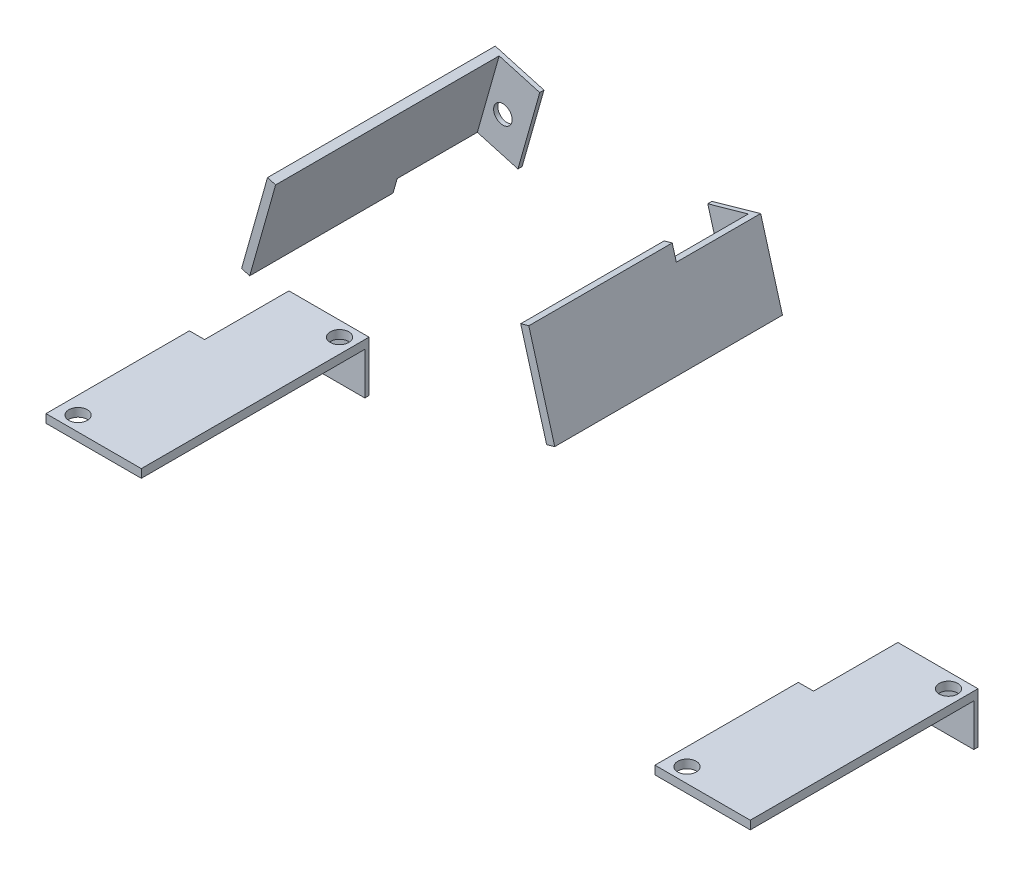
ISO-10303-21;
HEADER;
FILE_DESCRIPTION(('STEP AP214'),'2;1');
FILE_NAME('part.step','',(''),(''),'','','');
FILE_SCHEMA(('AUTOMOTIVE_DESIGN { 1 0 10303 214 1 1 1 1 }'));
ENDSEC;
DATA;
#1=APPLICATION_CONTEXT('core data for automotive mechanical design processes');
#2=APPLICATION_PROTOCOL_DEFINITION('international standard','automotive_design',2000,#1);
#3=PRODUCT_CONTEXT('',#1,'mechanical');
#4=PRODUCT('Part','Part','',(#3));
#5=PRODUCT_RELATED_PRODUCT_CATEGORY('part','',(#4));
#6=PRODUCT_DEFINITION_FORMATION('','',#4);
#7=PRODUCT_DEFINITION_CONTEXT('part definition',#1,'design');
#8=PRODUCT_DEFINITION('design','',#6,#7);
#9=PRODUCT_DEFINITION_SHAPE('','',#8);
#10=(LENGTH_UNIT() NAMED_UNIT(*) SI_UNIT(.MILLI.,.METRE.));
#11=(NAMED_UNIT(*) PLANE_ANGLE_UNIT() SI_UNIT($,.RADIAN.));
#12=(NAMED_UNIT(*) SI_UNIT($,.STERADIAN.) SOLID_ANGLE_UNIT());
#13=UNCERTAINTY_MEASURE_WITH_UNIT(LENGTH_MEASURE(1.E-05),#10,'distance_accuracy_value','');
#14=(GEOMETRIC_REPRESENTATION_CONTEXT(3) GLOBAL_UNCERTAINTY_ASSIGNED_CONTEXT((#13)) GLOBAL_UNIT_ASSIGNED_CONTEXT((#10,
#11,#12)) REPRESENTATION_CONTEXT('',''));
#15=CARTESIAN_POINT('',(0.,0.,0.));
#16=DIRECTION('',(0.,0.,1.));
#17=DIRECTION('',(1.,0.,0.));
#18=AXIS2_PLACEMENT_3D('',#15,#16,#17);
#19=CARTESIAN_POINT('',(-18.1233223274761,39.222379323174,27.));
#20=DIRECTION('',(0.272092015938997,0.96227123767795,0.));
#21=DIRECTION('',(-0.96227123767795,0.272092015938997,0.));
#22=AXIS2_PLACEMENT_3D('',#19,#20,#21);
#23=PLANE('',#22);
#24=DIRECTION('',(0.962271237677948,-0.272092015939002,0.));
#25=VECTOR('',#24,1.);
#26=CARTESIAN_POINT('',(-18.1233223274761,39.222379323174,10.));
#27=LINE('',#26,#25);
#28=CARTESIAN_POINT('',(-18.1233223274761,39.222379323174,10.));
#29=VERTEX_POINT('',#28);
#30=CARTESIAN_POINT('',(-17.1610510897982,38.950287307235,10.));
#31=VERTEX_POINT('',#30);
#32=EDGE_CURVE('E64',#29,#31,#27,.T.);
#33=ORIENTED_EDGE('',*,*,#32,.F.);
#34=DIRECTION('',(0.,0.,-1.));
#35=VECTOR('',#34,1.);
#36=CARTESIAN_POINT('',(-18.1233223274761,39.222379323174,27.));
#37=LINE('',#36,#35);
#38=CARTESIAN_POINT('',(-18.1233223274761,39.222379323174,0.));
#39=VERTEX_POINT('',#38);
#40=EDGE_CURVE('E138',#29,#39,#37,.T.);
#41=ORIENTED_EDGE('',*,*,#40,.T.);
#42=DIRECTION('',(0.96227123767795,-0.272092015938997,0.));
#43=VECTOR('',#42,1.);
#44=CARTESIAN_POINT('',(-18.1233223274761,39.222379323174,0.));
#45=LINE('',#44,#43);
#46=CARTESIAN_POINT('',(-12.3496949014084,37.5898272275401,0.));
#47=VERTEX_POINT('',#46);
#48=EDGE_CURVE('E172',#39,#47,#45,.T.);
#49=ORIENTED_EDGE('',*,*,#48,.T.);
#50=DIRECTION('',(0.,0.,-1.));
#51=VECTOR('',#50,1.);
#52=CARTESIAN_POINT('',(-12.3496949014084,37.5898272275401,27.));
#53=LINE('',#52,#51);
#54=CARTESIAN_POINT('',(-12.3496949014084,37.5898272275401,0.5));
#55=VERTEX_POINT('',#54);
#56=EDGE_CURVE('E158',#55,#47,#53,.T.);
#57=ORIENTED_EDGE('',*,*,#56,.F.);
#58=DIRECTION('',(0.962271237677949,-0.272092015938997,0.));
#59=VECTOR('',#58,1.);
#60=CARTESIAN_POINT('',(-12.3496949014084,37.5898272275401,0.5));
#61=LINE('',#60,#59);
#62=CARTESIAN_POINT('',(-17.1610510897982,38.950287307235,0.5));
#63=VERTEX_POINT('',#62);
#64=EDGE_CURVE('E146',#63,#55,#61,.T.);
#65=ORIENTED_EDGE('',*,*,#64,.F.);
#66=DIRECTION('',(0.,0.,1.));
#67=VECTOR('',#66,1.);
#68=CARTESIAN_POINT('',(-17.1610510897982,38.950287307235,0.5));
#69=LINE('',#68,#67);
#70=EDGE_CURVE('E139',#63,#31,#69,.T.);
#71=ORIENTED_EDGE('',*,*,#70,.T.);
#72=EDGE_LOOP('',(#33,#41,#49,#57,#65,#71));
#73=FACE_BOUND('',#72,.T.);
#74=ADVANCED_FACE('F48',(#73),#23,.F.);
#75=CARTESIAN_POINT('',(0.,0.,27.));
#76=DIRECTION('',(0.,0.,-1.));
#77=DIRECTION('',(-1.,0.,0.));
#78=AXIS2_PLACEMENT_3D('',#75,#76,#77);
#79=PLANE('',#78);
#80=DIRECTION('',(-0.272092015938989,-0.962271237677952,0.));
#81=VECTOR('',#80,1.);
#82=CARTESIAN_POINT('',(-18.1233223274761,39.222379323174,27.));
#83=LINE('',#82,#81);
#84=CARTESIAN_POINT('',(-15.5384481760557,48.3639560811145,27.));
#85=VERTEX_POINT('',#84);
#86=CARTESIAN_POINT('',(-18.6130879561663,37.4902910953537,27.));
#87=VERTEX_POINT('',#86);
#88=EDGE_CURVE('E169',#85,#87,#83,.T.);
#89=ORIENTED_EDGE('',*,*,#88,.T.);
#90=DIRECTION('',(-0.962271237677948,0.272092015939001,0.));
#91=VECTOR('',#90,1.);
#92=CARTESIAN_POINT('',(-18.6130879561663,37.4902910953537,27.));
#93=LINE('',#92,#91);
#94=CARTESIAN_POINT('',(-17.6508167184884,37.2181990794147,27.));
#95=VERTEX_POINT('',#94);
#96=EDGE_CURVE('E132',#95,#87,#93,.T.);
#97=ORIENTED_EDGE('',*,*,#96,.F.);
#98=DIRECTION('',(-0.272092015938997,-0.96227123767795,0.));
#99=VECTOR('',#98,1.);
#100=CARTESIAN_POINT('',(-17.1610510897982,38.950287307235,27.));
#101=LINE('',#100,#99);
#102=CARTESIAN_POINT('',(-14.5761769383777,48.0918640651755,27.));
#103=VERTEX_POINT('',#102);
#104=EDGE_CURVE('E148',#103,#95,#101,.T.);
#105=ORIENTED_EDGE('',*,*,#104,.F.);
#106=DIRECTION('',(-0.962271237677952,0.272092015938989,0.));
#107=VECTOR('',#106,1.);
#108=CARTESIAN_POINT('',(-15.5384481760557,48.3639560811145,27.));
#109=LINE('',#108,#107);
#110=EDGE_CURVE('E165',#103,#85,#109,.T.);
#111=ORIENTED_EDGE('',*,*,#110,.T.);
#112=EDGE_LOOP('',(#89,#97,#105,#111));
#113=FACE_BOUND('',#112,.T.);
#114=ADVANCED_FACE('F178',(#113),#79,.F.);
#115=CARTESIAN_POINT('',(0.,0.,0.));
#116=DIRECTION('',(0.,0.,-1.));
#117=DIRECTION('',(-1.,0.,0.));
#118=AXIS2_PLACEMENT_3D('',#115,#116,#117);
#119=PLANE('',#118);
#120=DIRECTION('',(-0.272092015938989,-0.962271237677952,0.));
#121=VECTOR('',#120,1.);
#122=CARTESIAN_POINT('',(-18.1233223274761,39.222379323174,0.));
#123=LINE('',#122,#121);
#124=CARTESIAN_POINT('',(-15.5384481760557,48.3639560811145,0.));
#125=VERTEX_POINT('',#124);
#126=EDGE_CURVE('E57',#125,#39,#123,.T.);
#127=ORIENTED_EDGE('',*,*,#126,.F.);
#128=DIRECTION('',(-0.962271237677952,0.272092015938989,0.));
#129=VECTOR('',#128,1.);
#130=CARTESIAN_POINT('',(-15.5384481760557,48.3639560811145,0.));
#131=LINE('',#130,#129);
#132=CARTESIAN_POINT('',(-9.76482074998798,46.7314039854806,0.));
#133=VERTEX_POINT('',#132);
#134=EDGE_CURVE('E166',#133,#125,#131,.T.);
#135=ORIENTED_EDGE('',*,*,#134,.F.);
#136=DIRECTION('',(0.272092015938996,0.96227123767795,0.));
#137=VECTOR('',#136,1.);
#138=CARTESIAN_POINT('',(-9.76482074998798,46.7314039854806,0.));
#139=LINE('',#138,#137);
#140=EDGE_CURVE('E168',#47,#133,#139,.T.);
#141=ORIENTED_EDGE('',*,*,#140,.F.);
#142=ORIENTED_EDGE('',*,*,#48,.F.);
#143=EDGE_LOOP('',(#127,#135,#141,#142));
#144=FACE_BOUND('',#143,.T.);
#145=CARTESIAN_POINT('',(-14.1349171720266,42.3019535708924,0.));
#146=DIRECTION('',(0.,0.,1.));
#147=DIRECTION('',(1.,0.,0.));
#148=AXIS2_PLACEMENT_3D('',#145,#146,#147);
#149=CIRCLE('',#148,1.09999999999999);
#150=CARTESIAN_POINT('',(-13.0349171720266,42.3019535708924,0.));
#151=VERTEX_POINT('',#150);
#152=EDGE_CURVE('E12',#151,#151,#149,.T.);
#153=ORIENTED_EDGE('',*,*,#152,.T.);
#154=EDGE_LOOP('',(#153));
#155=FACE_BOUND('',#154,.T.);
#156=ADVANCED_FACE('F187',(#144,#155),#119,.T.);
#157=CARTESIAN_POINT('',(-18.1233223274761,39.222379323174,27.));
#158=DIRECTION('',(0.962271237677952,-0.272092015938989,0.));
#159=DIRECTION('',(0.272092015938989,0.962271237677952,0.));
#160=AXIS2_PLACEMENT_3D('',#157,#158,#159);
#161=PLANE('',#160);
#162=ORIENTED_EDGE('',*,*,#126,.T.);
#163=ORIENTED_EDGE('',*,*,#40,.F.);
#164=DIRECTION('',(0.272092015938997,0.962271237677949,0.));
#165=VECTOR('',#164,1.);
#166=CARTESIAN_POINT('',(-18.6130879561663,37.4902910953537,10.));
#167=LINE('',#166,#165);
#168=CARTESIAN_POINT('',(-18.6130879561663,37.4902910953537,10.));
#169=VERTEX_POINT('',#168);
#170=EDGE_CURVE('E119',#169,#29,#167,.T.);
#171=ORIENTED_EDGE('',*,*,#170,.F.);
#172=DIRECTION('',(0.,0.,-1.));
#173=VECTOR('',#172,1.);
#174=CARTESIAN_POINT('',(-18.6130879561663,37.4902910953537,27.));
#175=LINE('',#174,#173);
#176=EDGE_CURVE('E126',#87,#169,#175,.T.);
#177=ORIENTED_EDGE('',*,*,#176,.F.);
#178=ORIENTED_EDGE('',*,*,#88,.F.);
#179=DIRECTION('',(0.,0.,-1.));
#180=VECTOR('',#179,1.);
#181=CARTESIAN_POINT('',(-15.5384481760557,48.3639560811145,27.));
#182=LINE('',#181,#180);
#183=EDGE_CURVE('E162',#85,#125,#182,.T.);
#184=ORIENTED_EDGE('',*,*,#183,.T.);
#185=EDGE_LOOP('',(#162,#163,#171,#177,#178,#184));
#186=FACE_BOUND('',#185,.T.);
#187=ADVANCED_FACE('F137',(#186),#161,.F.);
#188=CARTESIAN_POINT('',(-9.76482074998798,46.7314039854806,27.));
#189=DIRECTION('',(-0.96227123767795,0.272092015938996,0.));
#190=DIRECTION('',(-0.272092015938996,-0.96227123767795,0.));
#191=AXIS2_PLACEMENT_3D('',#188,#189,#190);
#192=PLANE('',#191);
#193=DIRECTION('',(0.,0.,-1.));
#194=VECTOR('',#193,1.);
#195=CARTESIAN_POINT('',(-9.76482074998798,46.7314039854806,27.));
#196=LINE('',#195,#194);
#197=CARTESIAN_POINT('',(-9.76482074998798,46.7314039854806,0.5));
#198=VERTEX_POINT('',#197);
#199=EDGE_CURVE('E160',#198,#133,#196,.T.);
#200=ORIENTED_EDGE('',*,*,#199,.F.);
#201=DIRECTION('',(0.272092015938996,0.96227123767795,0.));
#202=VECTOR('',#201,1.);
#203=CARTESIAN_POINT('',(-9.76482074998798,46.7314039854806,0.5));
#204=LINE('',#203,#202);
#205=EDGE_CURVE('E72',#55,#198,#204,.T.);
#206=ORIENTED_EDGE('',*,*,#205,.F.);
#207=ORIENTED_EDGE('',*,*,#56,.T.);
#208=ORIENTED_EDGE('',*,*,#140,.T.);
#209=EDGE_LOOP('',(#200,#206,#207,#208));
#210=FACE_BOUND('',#209,.T.);
#211=ADVANCED_FACE('F194',(#210),#192,.F.);
#212=CARTESIAN_POINT('',(-15.5384481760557,48.3639560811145,27.));
#213=DIRECTION('',(-0.272092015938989,-0.962271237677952,0.));
#214=DIRECTION('',(0.962271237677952,-0.272092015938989,0.));
#215=AXIS2_PLACEMENT_3D('',#212,#213,#214);
#216=PLANE('',#215);
#217=ORIENTED_EDGE('',*,*,#110,.F.);
#218=DIRECTION('',(0.,0.,1.));
#219=VECTOR('',#218,1.);
#220=CARTESIAN_POINT('',(-14.5761769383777,48.0918640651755,0.5));
#221=LINE('',#220,#219);
#222=CARTESIAN_POINT('',(-14.5761769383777,48.0918640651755,0.5));
#223=VERTEX_POINT('',#222);
#224=EDGE_CURVE('E141',#223,#103,#221,.T.);
#225=ORIENTED_EDGE('',*,*,#224,.F.);
#226=DIRECTION('',(-0.962271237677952,0.272092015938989,0.));
#227=VECTOR('',#226,1.);
#228=CARTESIAN_POINT('',(-14.5761769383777,48.0918640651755,0.5));
#229=LINE('',#228,#227);
#230=EDGE_CURVE('E154',#198,#223,#229,.T.);
#231=ORIENTED_EDGE('',*,*,#230,.F.);
#232=ORIENTED_EDGE('',*,*,#199,.T.);
#233=ORIENTED_EDGE('',*,*,#134,.T.);
#234=ORIENTED_EDGE('',*,*,#183,.F.);
#235=EDGE_LOOP('',(#217,#225,#231,#232,#233,#234));
#236=FACE_BOUND('',#235,.T.);
#237=ADVANCED_FACE('F195',(#236),#216,.F.);
#238=CARTESIAN_POINT('',(-14.1349171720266,42.3019535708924,27.));
#239=DIRECTION('',(0.,0.,-1.));
#240=DIRECTION('',(-1.,0.,0.));
#241=AXIS2_PLACEMENT_3D('',#238,#239,#240);
#242=CYLINDRICAL_SURFACE('',#241,1.09999999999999);
#243=CARTESIAN_POINT('',(-14.1349171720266,42.3019535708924,0.5));
#244=DIRECTION('',(0.,0.,-1.));
#245=DIRECTION('',(-1.,0.,0.));
#246=AXIS2_PLACEMENT_3D('',#243,#244,#245);
#247=CIRCLE('',#246,1.09999999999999);
#248=CARTESIAN_POINT('',(-15.2349171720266,42.3019535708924,0.5));
#249=VERTEX_POINT('',#248);
#250=EDGE_CURVE('E52',#249,#249,#247,.T.);
#251=ORIENTED_EDGE('',*,*,#250,.F.);
#252=EDGE_LOOP('',(#251));
#253=FACE_BOUND('',#252,.T.);
#254=ORIENTED_EDGE('',*,*,#152,.F.);
#255=EDGE_LOOP('',(#254));
#256=FACE_BOUND('',#255,.T.);
#257=ADVANCED_FACE('F50',(#253,#256),#242,.F.);
#258=CARTESIAN_POINT('',(-17.1610510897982,38.950287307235,0.5));
#259=DIRECTION('',(-0.96227123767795,0.272092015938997,0.));
#260=DIRECTION('',(-0.272092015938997,-0.96227123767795,0.));
#261=AXIS2_PLACEMENT_3D('',#258,#259,#260);
#262=PLANE('',#261);
#263=ORIENTED_EDGE('',*,*,#104,.T.);
#264=DIRECTION('',(0.,0.,1.));
#265=VECTOR('',#264,1.);
#266=CARTESIAN_POINT('',(-17.6508167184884,37.2181990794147,27.));
#267=LINE('',#266,#265);
#268=CARTESIAN_POINT('',(-17.6508167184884,37.2181990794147,10.));
#269=VERTEX_POINT('',#268);
#270=EDGE_CURVE('E125',#269,#95,#267,.T.);
#271=ORIENTED_EDGE('',*,*,#270,.F.);
#272=DIRECTION('',(0.272092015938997,0.962271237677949,0.));
#273=VECTOR('',#272,1.);
#274=CARTESIAN_POINT('',(-17.6508167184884,37.2181990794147,10.));
#275=LINE('',#274,#273);
#276=EDGE_CURVE('E121',#269,#31,#275,.T.);
#277=ORIENTED_EDGE('',*,*,#276,.T.);
#278=ORIENTED_EDGE('',*,*,#70,.F.);
#279=DIRECTION('',(-0.272092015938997,-0.96227123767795,0.));
#280=VECTOR('',#279,1.);
#281=CARTESIAN_POINT('',(-17.1610510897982,38.950287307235,0.5));
#282=LINE('',#281,#280);
#283=EDGE_CURVE('E151',#223,#63,#282,.T.);
#284=ORIENTED_EDGE('',*,*,#283,.F.);
#285=ORIENTED_EDGE('',*,*,#224,.T.);
#286=EDGE_LOOP('',(#263,#271,#277,#278,#284,#285));
#287=FACE_BOUND('',#286,.T.);
#288=ADVANCED_FACE('F199',(#287),#262,.F.);
#289=CARTESIAN_POINT('',(0.,0.,0.5));
#290=DIRECTION('',(0.,0.,-1.));
#291=DIRECTION('',(-1.,0.,0.));
#292=AXIS2_PLACEMENT_3D('',#289,#290,#291);
#293=PLANE('',#292);
#294=ORIENTED_EDGE('',*,*,#250,.T.);
#295=EDGE_LOOP('',(#294));
#296=FACE_BOUND('',#295,.T.);
#297=ORIENTED_EDGE('',*,*,#205,.T.);
#298=ORIENTED_EDGE('',*,*,#230,.T.);
#299=ORIENTED_EDGE('',*,*,#283,.T.);
#300=ORIENTED_EDGE('',*,*,#64,.T.);
#301=EDGE_LOOP('',(#297,#298,#299,#300));
#302=FACE_BOUND('',#301,.T.);
#303=ADVANCED_FACE('F197',(#296,#302),#293,.F.);
#304=CARTESIAN_POINT('',(-18.6130879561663,37.4902910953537,10.));
#305=DIRECTION('',(0.,0.,1.));
#306=DIRECTION('',(1.,0.,0.));
#307=AXIS2_PLACEMENT_3D('',#304,#305,#306);
#308=PLANE('',#307);
#309=ORIENTED_EDGE('',*,*,#32,.T.);
#310=ORIENTED_EDGE('',*,*,#276,.F.);
#311=DIRECTION('',(0.962271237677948,-0.272092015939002,0.));
#312=VECTOR('',#311,1.);
#313=CARTESIAN_POINT('',(-18.6130879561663,37.4902910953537,10.));
#314=LINE('',#313,#312);
#315=EDGE_CURVE('E115',#169,#269,#314,.T.);
#316=ORIENTED_EDGE('',*,*,#315,.F.);
#317=ORIENTED_EDGE('',*,*,#170,.T.);
#318=EDGE_LOOP('',(#309,#310,#316,#317));
#319=FACE_BOUND('',#318,.T.);
#320=ADVANCED_FACE('F117',(#319),#308,.F.);
#321=CARTESIAN_POINT('',(8.4379424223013,29.8413361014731,0.));
#322=DIRECTION('',(-0.272092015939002,-0.962271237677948,0.));
#323=DIRECTION('',(0.962271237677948,-0.272092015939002,0.));
#324=AXIS2_PLACEMENT_3D('',#321,#322,#323);
#325=PLANE('',#324);
#326=ORIENTED_EDGE('',*,*,#176,.T.);
#327=ORIENTED_EDGE('',*,*,#315,.T.);
#328=ORIENTED_EDGE('',*,*,#270,.T.);
#329=ORIENTED_EDGE('',*,*,#96,.T.);
#330=EDGE_LOOP('',(#326,#327,#328,#329));
#331=FACE_BOUND('',#330,.T.);
#332=ADVANCED_FACE('F130',(#331),#325,.T.);
#333=CLOSED_SHELL('',(#74,#114,#156,#187,#211,#237,#257,#288,#303,#320,#332));
#334=MANIFOLD_SOLID_BREP('B2',#333);
#335=CARTESIAN_POINT('',(15.9278900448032,46.9041425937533,27.));
#336=DIRECTION('',(0.272092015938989,-0.962271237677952,0.));
#337=DIRECTION('',(0.962271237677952,0.272092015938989,0.));
#338=AXIS2_PLACEMENT_3D('',#335,#336,#337);
#339=PLANE('',#338);
#340=DIRECTION('',(-0.962271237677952,-0.272092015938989,0.));
#341=VECTOR('',#340,1.);
#342=CARTESIAN_POINT('',(15.9278900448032,46.9041425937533,10.));
#343=LINE('',#342,#341);
#344=CARTESIAN_POINT('',(15.9278900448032,46.9041425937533,10.));
#345=VERTEX_POINT('',#344);
#346=CARTESIAN_POINT('',(14.9656188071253,46.6320505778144,10.));
#347=VERTEX_POINT('',#346);
#348=EDGE_CURVE('E354',#345,#347,#343,.T.);
#349=ORIENTED_EDGE('',*,*,#348,.F.);
#350=DIRECTION('',(0.,0.,-1.));
#351=VECTOR('',#350,1.);
#352=CARTESIAN_POINT('',(15.9278900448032,46.9041425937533,27.));
#353=LINE('',#352,#351);
#354=CARTESIAN_POINT('',(15.9278900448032,46.9041425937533,0.));
#355=VERTEX_POINT('',#354);
#356=EDGE_CURVE('E428',#345,#355,#353,.T.);
#357=ORIENTED_EDGE('',*,*,#356,.T.);
#358=DIRECTION('',(-0.962271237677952,-0.272092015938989,0.));
#359=VECTOR('',#358,1.);
#360=CARTESIAN_POINT('',(15.9278900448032,46.9041425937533,0.));
#361=LINE('',#360,#359);
#362=CARTESIAN_POINT('',(10.1542626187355,45.2715904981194,0.));
#363=VERTEX_POINT('',#362);
#364=EDGE_CURVE('E462',#355,#363,#361,.T.);
#365=ORIENTED_EDGE('',*,*,#364,.T.);
#366=DIRECTION('',(0.,0.,-1.));
#367=VECTOR('',#366,1.);
#368=CARTESIAN_POINT('',(10.1542626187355,45.2715904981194,27.));
#369=LINE('',#368,#367);
#370=CARTESIAN_POINT('',(10.1542626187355,45.2715904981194,0.5));
#371=VERTEX_POINT('',#370);
#372=EDGE_CURVE('E448',#371,#363,#369,.T.);
#373=ORIENTED_EDGE('',*,*,#372,.F.);
#374=DIRECTION('',(-0.962271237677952,-0.272092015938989,0.));
#375=VECTOR('',#374,1.);
#376=CARTESIAN_POINT('',(10.1542626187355,45.2715904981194,0.5));
#377=LINE('',#376,#375);
#378=CARTESIAN_POINT('',(14.9656188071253,46.6320505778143,0.5));
#379=VERTEX_POINT('',#378);
#380=EDGE_CURVE('E436',#379,#371,#377,.T.);
#381=ORIENTED_EDGE('',*,*,#380,.F.);
#382=DIRECTION('',(0.,0.,1.));
#383=VECTOR('',#382,1.);
#384=CARTESIAN_POINT('',(14.9656188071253,46.6320505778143,0.5));
#385=LINE('',#384,#383);
#386=EDGE_CURVE('E429',#379,#347,#385,.T.);
#387=ORIENTED_EDGE('',*,*,#386,.T.);
#388=EDGE_LOOP('',(#349,#357,#365,#373,#381,#387));
#389=FACE_BOUND('',#388,.T.);
#390=ADVANCED_FACE('F338',(#389),#339,.F.);
#391=CARTESIAN_POINT('',(0.,0.,27.));
#392=DIRECTION('',(0.,0.,1.));
#393=DIRECTION('',(1.,0.,0.));
#394=AXIS2_PLACEMENT_3D('',#391,#392,#393);
#395=PLANE('',#394);
#396=DIRECTION('',(-0.272092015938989,0.962271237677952,0.));
#397=VECTOR('',#396,1.);
#398=CARTESIAN_POINT('',(14.9656188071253,46.6320505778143,27.));
#399=LINE('',#398,#397);
#400=CARTESIAN_POINT('',(17.5504929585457,37.4904738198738,27.));
#401=VERTEX_POINT('',#400);
#402=CARTESIAN_POINT('',(14.4758531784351,48.3641388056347,27.));
#403=VERTEX_POINT('',#402);
#404=EDGE_CURVE('E438',#401,#403,#399,.T.);
#405=ORIENTED_EDGE('',*,*,#404,.F.);
#406=DIRECTION('',(0.962271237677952,0.272092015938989,0.));
#407=VECTOR('',#406,1.);
#408=CARTESIAN_POINT('',(12.7391367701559,36.1300137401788,27.));
#409=LINE('',#408,#407);
#410=CARTESIAN_POINT('',(18.5127641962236,37.7625658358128,27.));
#411=VERTEX_POINT('',#410);
#412=EDGE_CURVE('E455',#401,#411,#409,.T.);
#413=ORIENTED_EDGE('',*,*,#412,.T.);
#414=DIRECTION('',(-0.272092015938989,0.962271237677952,0.));
#415=VECTOR('',#414,1.);
#416=CARTESIAN_POINT('',(15.9278900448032,46.9041425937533,27.));
#417=LINE('',#416,#415);
#418=CARTESIAN_POINT('',(15.438124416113,48.6362308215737,27.));
#419=VERTEX_POINT('',#418);
#420=EDGE_CURVE('E459',#411,#419,#417,.T.);
#421=ORIENTED_EDGE('',*,*,#420,.T.);
#422=DIRECTION('',(0.962271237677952,0.272092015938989,0.));
#423=VECTOR('',#422,1.);
#424=CARTESIAN_POINT('',(15.438124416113,48.6362308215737,27.));
#425=LINE('',#424,#423);
#426=EDGE_CURVE('E422',#403,#419,#425,.T.);
#427=ORIENTED_EDGE('',*,*,#426,.F.);
#428=EDGE_LOOP('',(#405,#413,#421,#427));
#429=FACE_BOUND('',#428,.T.);
#430=ADVANCED_FACE('F469',(#429),#395,.T.);
#431=CARTESIAN_POINT('',(0.,0.,0.));
#432=DIRECTION('',(0.,0.,1.));
#433=DIRECTION('',(1.,0.,0.));
#434=AXIS2_PLACEMENT_3D('',#431,#432,#433);
#435=PLANE('',#434);
#436=DIRECTION('',(-0.272092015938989,0.962271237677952,0.));
#437=VECTOR('',#436,1.);
#438=CARTESIAN_POINT('',(15.9278900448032,46.9041425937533,0.));
#439=LINE('',#438,#437);
#440=CARTESIAN_POINT('',(18.5127641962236,37.7625658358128,0.));
#441=VERTEX_POINT('',#440);
#442=EDGE_CURVE('E347',#441,#355,#439,.T.);
#443=ORIENTED_EDGE('',*,*,#442,.F.);
#444=DIRECTION('',(0.962271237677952,0.272092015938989,0.));
#445=VECTOR('',#444,1.);
#446=CARTESIAN_POINT('',(12.7391367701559,36.1300137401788,0.));
#447=LINE('',#446,#445);
#448=CARTESIAN_POINT('',(12.7391367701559,36.1300137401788,0.));
#449=VERTEX_POINT('',#448);
#450=EDGE_CURVE('E456',#449,#441,#447,.T.);
#451=ORIENTED_EDGE('',*,*,#450,.F.);
#452=DIRECTION('',(0.272092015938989,-0.962271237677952,0.));
#453=VECTOR('',#452,1.);
#454=CARTESIAN_POINT('',(10.1542626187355,45.2715904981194,0.));
#455=LINE('',#454,#453);
#456=EDGE_CURVE('E458',#363,#449,#455,.T.);
#457=ORIENTED_EDGE('',*,*,#456,.F.);
#458=ORIENTED_EDGE('',*,*,#364,.F.);
#459=EDGE_LOOP('',(#443,#451,#457,#458));
#460=FACE_BOUND('',#459,.T.);
#461=CARTESIAN_POINT('',(14.1349171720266,42.3019535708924,0.));
#462=DIRECTION('',(0.,0.,1.));
#463=DIRECTION('',(1.,0.,0.));
#464=AXIS2_PLACEMENT_3D('',#461,#462,#463);
#465=CIRCLE('',#464,1.09999999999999);
#466=CARTESIAN_POINT('',(15.2349171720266,42.3019535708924,0.));
#467=VERTEX_POINT('',#466);
#468=EDGE_CURVE('E46',#467,#467,#465,.T.);
#469=ORIENTED_EDGE('',*,*,#468,.T.);
#470=EDGE_LOOP('',(#469));
#471=FACE_BOUND('',#470,.T.);
#472=ADVANCED_FACE('F477',(#460,#471),#435,.F.);
#473=CARTESIAN_POINT('',(15.9278900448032,46.9041425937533,27.));
#474=DIRECTION('',(-0.962271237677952,-0.272092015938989,0.));
#475=DIRECTION('',(0.272092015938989,-0.962271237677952,0.));
#476=AXIS2_PLACEMENT_3D('',#473,#474,#475);
#477=PLANE('',#476);
#478=ORIENTED_EDGE('',*,*,#442,.T.);
#479=ORIENTED_EDGE('',*,*,#356,.F.);
#480=DIRECTION('',(0.272092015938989,-0.962271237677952,0.));
#481=VECTOR('',#480,1.);
#482=CARTESIAN_POINT('',(15.438124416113,48.6362308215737,10.));
#483=LINE('',#482,#481);
#484=CARTESIAN_POINT('',(15.438124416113,48.6362308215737,10.));
#485=VERTEX_POINT('',#484);
#486=EDGE_CURVE('E409',#485,#345,#483,.T.);
#487=ORIENTED_EDGE('',*,*,#486,.F.);
#488=DIRECTION('',(0.,0.,-1.));
#489=VECTOR('',#488,1.);
#490=CARTESIAN_POINT('',(15.438124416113,48.6362308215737,27.));
#491=LINE('',#490,#489);
#492=EDGE_CURVE('E416',#419,#485,#491,.T.);
#493=ORIENTED_EDGE('',*,*,#492,.F.);
#494=ORIENTED_EDGE('',*,*,#420,.F.);
#495=DIRECTION('',(0.,0.,-1.));
#496=VECTOR('',#495,1.);
#497=CARTESIAN_POINT('',(18.5127641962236,37.7625658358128,27.));
#498=LINE('',#497,#496);
#499=EDGE_CURVE('E452',#411,#441,#498,.T.);
#500=ORIENTED_EDGE('',*,*,#499,.T.);
#501=EDGE_LOOP('',(#478,#479,#487,#493,#494,#500));
#502=FACE_BOUND('',#501,.T.);
#503=ADVANCED_FACE('F427',(#502),#477,.F.);
#504=CARTESIAN_POINT('',(10.1542626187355,45.2715904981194,27.));
#505=DIRECTION('',(0.962271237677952,0.272092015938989,0.));
#506=DIRECTION('',(-0.272092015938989,0.962271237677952,0.));
#507=AXIS2_PLACEMENT_3D('',#504,#505,#506);
#508=PLANE('',#507);
#509=DIRECTION('',(0.,0.,-1.));
#510=VECTOR('',#509,1.);
#511=CARTESIAN_POINT('',(12.7391367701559,36.1300137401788,27.));
#512=LINE('',#511,#510);
#513=CARTESIAN_POINT('',(12.7391367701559,36.1300137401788,0.5));
#514=VERTEX_POINT('',#513);
#515=EDGE_CURVE('E450',#514,#449,#512,.T.);
#516=ORIENTED_EDGE('',*,*,#515,.F.);
#517=DIRECTION('',(0.272092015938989,-0.962271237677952,0.));
#518=VECTOR('',#517,1.);
#519=CARTESIAN_POINT('',(12.7391367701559,36.1300137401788,0.5));
#520=LINE('',#519,#518);
#521=EDGE_CURVE('E362',#371,#514,#520,.T.);
#522=ORIENTED_EDGE('',*,*,#521,.F.);
#523=ORIENTED_EDGE('',*,*,#372,.T.);
#524=ORIENTED_EDGE('',*,*,#456,.T.);
#525=EDGE_LOOP('',(#516,#522,#523,#524));
#526=FACE_BOUND('',#525,.T.);
#527=ADVANCED_FACE('F484',(#526),#508,.F.);
#528=CARTESIAN_POINT('',(12.7391367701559,36.1300137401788,27.));
#529=DIRECTION('',(-0.272092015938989,0.962271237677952,0.));
#530=DIRECTION('',(-0.962271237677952,-0.272092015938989,0.));
#531=AXIS2_PLACEMENT_3D('',#528,#529,#530);
#532=PLANE('',#531);
#533=ORIENTED_EDGE('',*,*,#412,.F.);
#534=DIRECTION('',(0.,0.,1.));
#535=VECTOR('',#534,1.);
#536=CARTESIAN_POINT('',(17.5504929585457,37.4904738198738,0.5));
#537=LINE('',#536,#535);
#538=CARTESIAN_POINT('',(17.5504929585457,37.4904738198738,0.5));
#539=VERTEX_POINT('',#538);
#540=EDGE_CURVE('E431',#539,#401,#537,.T.);
#541=ORIENTED_EDGE('',*,*,#540,.F.);
#542=DIRECTION('',(0.962271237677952,0.272092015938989,0.));
#543=VECTOR('',#542,1.);
#544=CARTESIAN_POINT('',(17.5504929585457,37.4904738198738,0.5));
#545=LINE('',#544,#543);
#546=EDGE_CURVE('E444',#514,#539,#545,.T.);
#547=ORIENTED_EDGE('',*,*,#546,.F.);
#548=ORIENTED_EDGE('',*,*,#515,.T.);
#549=ORIENTED_EDGE('',*,*,#450,.T.);
#550=ORIENTED_EDGE('',*,*,#499,.F.);
#551=EDGE_LOOP('',(#533,#541,#547,#548,#549,#550));
#552=FACE_BOUND('',#551,.T.);
#553=ADVANCED_FACE('F485',(#552),#532,.F.);
#554=CARTESIAN_POINT('',(14.1349171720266,42.3019535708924,27.));
#555=DIRECTION('',(0.,0.,-1.));
#556=DIRECTION('',(-1.,0.,0.));
#557=AXIS2_PLACEMENT_3D('',#554,#555,#556);
#558=CYLINDRICAL_SURFACE('',#557,1.09999999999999);
#559=CARTESIAN_POINT('',(14.1349171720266,42.3019535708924,0.5));
#560=DIRECTION('',(0.,0.,-1.));
#561=DIRECTION('',(-1.,0.,0.));
#562=AXIS2_PLACEMENT_3D('',#559,#560,#561);
#563=CIRCLE('',#562,1.09999999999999);
#564=CARTESIAN_POINT('',(13.0349171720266,42.3019535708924,0.5));
#565=VERTEX_POINT('',#564);
#566=EDGE_CURVE('E342',#565,#565,#563,.T.);
#567=ORIENTED_EDGE('',*,*,#566,.F.);
#568=EDGE_LOOP('',(#567));
#569=FACE_BOUND('',#568,.T.);
#570=ORIENTED_EDGE('',*,*,#468,.F.);
#571=EDGE_LOOP('',(#570));
#572=FACE_BOUND('',#571,.T.);
#573=ADVANCED_FACE('F340',(#569,#572),#558,.F.);
#574=CARTESIAN_POINT('',(14.9656188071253,46.6320505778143,0.5));
#575=DIRECTION('',(0.962271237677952,0.272092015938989,0.));
#576=DIRECTION('',(-0.272092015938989,0.962271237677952,0.));
#577=AXIS2_PLACEMENT_3D('',#574,#575,#576);
#578=PLANE('',#577);
#579=ORIENTED_EDGE('',*,*,#404,.T.);
#580=DIRECTION('',(0.,0.,1.));
#581=VECTOR('',#580,1.);
#582=CARTESIAN_POINT('',(14.4758531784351,48.3641388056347,27.));
#583=LINE('',#582,#581);
#584=CARTESIAN_POINT('',(14.4758531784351,48.3641388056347,10.));
#585=VERTEX_POINT('',#584);
#586=EDGE_CURVE('E415',#585,#403,#583,.T.);
#587=ORIENTED_EDGE('',*,*,#586,.F.);
#588=DIRECTION('',(0.272092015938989,-0.962271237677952,0.));
#589=VECTOR('',#588,1.);
#590=CARTESIAN_POINT('',(14.4758531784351,48.3641388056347,10.));
#591=LINE('',#590,#589);
#592=EDGE_CURVE('E411',#585,#347,#591,.T.);
#593=ORIENTED_EDGE('',*,*,#592,.T.);
#594=ORIENTED_EDGE('',*,*,#386,.F.);
#595=DIRECTION('',(-0.272092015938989,0.962271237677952,0.));
#596=VECTOR('',#595,1.);
#597=CARTESIAN_POINT('',(14.9656188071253,46.6320505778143,0.5));
#598=LINE('',#597,#596);
#599=EDGE_CURVE('E441',#539,#379,#598,.T.);
#600=ORIENTED_EDGE('',*,*,#599,.F.);
#601=ORIENTED_EDGE('',*,*,#540,.T.);
#602=EDGE_LOOP('',(#579,#587,#593,#594,#600,#601));
#603=FACE_BOUND('',#602,.T.);
#604=ADVANCED_FACE('F489',(#603),#578,.F.);
#605=CARTESIAN_POINT('',(0.,0.,0.5));
#606=DIRECTION('',(0.,0.,-1.));
#607=DIRECTION('',(-1.,0.,0.));
#608=AXIS2_PLACEMENT_3D('',#605,#606,#607);
#609=PLANE('',#608);
#610=ORIENTED_EDGE('',*,*,#566,.T.);
#611=EDGE_LOOP('',(#610));
#612=FACE_BOUND('',#611,.T.);
#613=ORIENTED_EDGE('',*,*,#521,.T.);
#614=ORIENTED_EDGE('',*,*,#546,.T.);
#615=ORIENTED_EDGE('',*,*,#599,.T.);
#616=ORIENTED_EDGE('',*,*,#380,.T.);
#617=EDGE_LOOP('',(#613,#614,#615,#616));
#618=FACE_BOUND('',#617,.T.);
#619=ADVANCED_FACE('F487',(#612,#618),#609,.F.);
#620=CARTESIAN_POINT('',(15.438124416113,48.6362308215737,10.));
#621=DIRECTION('',(0.,0.,1.));
#622=DIRECTION('',(1.,0.,0.));
#623=AXIS2_PLACEMENT_3D('',#620,#621,#622);
#624=PLANE('',#623);
#625=ORIENTED_EDGE('',*,*,#348,.T.);
#626=ORIENTED_EDGE('',*,*,#592,.F.);
#627=DIRECTION('',(-0.962271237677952,-0.272092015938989,0.));
#628=VECTOR('',#627,1.);
#629=CARTESIAN_POINT('',(15.438124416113,48.6362308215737,10.));
#630=LINE('',#629,#628);
#631=EDGE_CURVE('E405',#485,#585,#630,.T.);
#632=ORIENTED_EDGE('',*,*,#631,.F.);
#633=ORIENTED_EDGE('',*,*,#486,.T.);
#634=EDGE_LOOP('',(#625,#626,#632,#633));
#635=FACE_BOUND('',#634,.T.);
#636=ADVANCED_FACE('F407',(#635),#624,.F.);
#637=CARTESIAN_POINT('',(-11.5912982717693,40.9933856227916,0.));
#638=DIRECTION('',(-0.272092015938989,0.962271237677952,0.));
#639=DIRECTION('',(-0.962271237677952,-0.272092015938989,0.));
#640=AXIS2_PLACEMENT_3D('',#637,#638,#639);
#641=PLANE('',#640);
#642=ORIENTED_EDGE('',*,*,#492,.T.);
#643=ORIENTED_EDGE('',*,*,#631,.T.);
#644=ORIENTED_EDGE('',*,*,#586,.T.);
#645=ORIENTED_EDGE('',*,*,#426,.T.);
#646=EDGE_LOOP('',(#642,#643,#644,#645));
#647=FACE_BOUND('',#646,.T.);
#648=ADVANCED_FACE('F420',(#647),#641,.T.);
#649=CLOSED_SHELL('',(#390,#430,#472,#503,#527,#553,#573,#604,#619,#636,#648));
#650=MANIFOLD_SOLID_BREP('B6',#649);
#651=CARTESIAN_POINT('',(32.1928108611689,4.99999999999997,27.));
#652=DIRECTION('',(1.,0.,0.));
#653=DIRECTION('',(0.,0.,-1.));
#654=AXIS2_PLACEMENT_3D('',#651,#652,#653);
#655=PLANE('',#654);
#656=DIRECTION('',(0.,-1.,0.));
#657=VECTOR('',#656,1.);
#658=CARTESIAN_POINT('',(32.1928108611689,10.9999999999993,10.));
#659=LINE('',#658,#657);
#660=CARTESIAN_POINT('',(32.1928108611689,10.9999999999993,10.));
#661=VERTEX_POINT('',#660);
#662=CARTESIAN_POINT('',(32.1928108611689,10.,10.));
#663=VERTEX_POINT('',#662);
#664=EDGE_CURVE('E643',#661,#663,#659,.T.);
#665=ORIENTED_EDGE('',*,*,#664,.F.);
#666=DIRECTION('',(0.,0.,-1.));
#667=VECTOR('',#666,1.);
#668=CARTESIAN_POINT('',(32.1928108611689,10.9999999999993,27.));
#669=LINE('',#668,#667);
#670=CARTESIAN_POINT('',(32.1928108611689,10.9999999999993,0.));
#671=VERTEX_POINT('',#670);
#672=EDGE_CURVE('E704',#661,#671,#669,.T.);
#673=ORIENTED_EDGE('',*,*,#672,.T.);
#674=DIRECTION('',(0.,-1.,0.));
#675=VECTOR('',#674,1.);
#676=CARTESIAN_POINT('',(32.1928108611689,4.99999999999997,0.));
#677=LINE('',#676,#675);
#678=CARTESIAN_POINT('',(32.1928108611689,4.99999999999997,0.));
#679=VERTEX_POINT('',#678);
#680=EDGE_CURVE('E636',#671,#679,#677,.T.);
#681=ORIENTED_EDGE('',*,*,#680,.T.);
#682=DIRECTION('',(0.,0.,-1.));
#683=VECTOR('',#682,1.);
#684=CARTESIAN_POINT('',(32.1928108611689,4.99999999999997,27.));
#685=LINE('',#684,#683);
#686=CARTESIAN_POINT('',(32.1928108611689,4.99999999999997,0.5));
#687=VERTEX_POINT('',#686);
#688=EDGE_CURVE('E747',#687,#679,#685,.T.);
#689=ORIENTED_EDGE('',*,*,#688,.F.);
#690=DIRECTION('',(0.,-1.,0.));
#691=VECTOR('',#690,1.);
#692=CARTESIAN_POINT('',(32.1928108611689,4.99999999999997,0.5));
#693=LINE('',#692,#691);
#694=CARTESIAN_POINT('',(32.1928108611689,10.,0.5));
#695=VERTEX_POINT('',#694);
#696=EDGE_CURVE('E740',#695,#687,#693,.T.);
#697=ORIENTED_EDGE('',*,*,#696,.F.);
#698=DIRECTION('',(0.,0.,1.));
#699=VECTOR('',#698,1.);
#700=CARTESIAN_POINT('',(32.1928108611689,10.,0.5));
#701=LINE('',#700,#699);
#702=EDGE_CURVE('E733',#695,#663,#701,.T.);
#703=ORIENTED_EDGE('',*,*,#702,.T.);
#704=EDGE_LOOP('',(#665,#673,#681,#689,#697,#703));
#705=FACE_BOUND('',#704,.T.);
#706=ADVANCED_FACE('F627',(#705),#655,.F.);
#707=CARTESIAN_POINT('',(0.,0.,27.));
#708=DIRECTION('',(0.,0.,-1.));
#709=DIRECTION('',(-1.,0.,0.));
#710=AXIS2_PLACEMENT_3D('',#707,#708,#709);
#711=PLANE('',#710);
#712=DIRECTION('',(-1.,0.,0.));
#713=VECTOR('',#712,1.);
#714=CARTESIAN_POINT('',(32.1928108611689,10.9999999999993,27.));
#715=LINE('',#714,#713);
#716=CARTESIAN_POINT('',(41.6928108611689,10.9999999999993,27.));
#717=VERTEX_POINT('',#716);
#718=CARTESIAN_POINT('',(30.3928108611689,10.9999999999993,27.));
#719=VERTEX_POINT('',#718);
#720=EDGE_CURVE('E693',#717,#719,#715,.T.);
#721=ORIENTED_EDGE('',*,*,#720,.T.);
#722=DIRECTION('',(0.,1.,0.));
#723=VECTOR('',#722,1.);
#724=CARTESIAN_POINT('',(30.3928108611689,10.9999999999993,27.));
#725=LINE('',#724,#723);
#726=CARTESIAN_POINT('',(30.3928108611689,10.,27.));
#727=VERTEX_POINT('',#726);
#728=EDGE_CURVE('E698',#727,#719,#725,.T.);
#729=ORIENTED_EDGE('',*,*,#728,.F.);
#730=DIRECTION('',(-1.,0.,0.));
#731=VECTOR('',#730,1.);
#732=CARTESIAN_POINT('',(32.1928108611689,10.,27.));
#733=LINE('',#732,#731);
#734=CARTESIAN_POINT('',(41.6928108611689,10.,27.));
#735=VERTEX_POINT('',#734);
#736=EDGE_CURVE('E738',#735,#727,#733,.T.);
#737=ORIENTED_EDGE('',*,*,#736,.F.);
#738=DIRECTION('',(0.,1.,0.));
#739=VECTOR('',#738,1.);
#740=CARTESIAN_POINT('',(41.6928108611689,10.9999999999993,27.));
#741=LINE('',#740,#739);
#742=EDGE_CURVE('E700',#735,#717,#741,.T.);
#743=ORIENTED_EDGE('',*,*,#742,.T.);
#744=EDGE_LOOP('',(#721,#729,#737,#743));
#745=FACE_BOUND('',#744,.T.);
#746=ADVANCED_FACE('F695',(#745),#711,.F.);
#747=CARTESIAN_POINT('',(0.,0.,0.));
#748=DIRECTION('',(0.,0.,-1.));
#749=DIRECTION('',(-1.,0.,0.));
#750=AXIS2_PLACEMENT_3D('',#747,#748,#749);
#751=PLANE('',#750);
#752=ORIENTED_EDGE('',*,*,#680,.F.);
#753=DIRECTION('',(-1.,0.,0.));
#754=VECTOR('',#753,1.);
#755=CARTESIAN_POINT('',(32.1928108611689,10.9999999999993,0.));
#756=LINE('',#755,#754);
#757=CARTESIAN_POINT('',(41.6928108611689,10.9999999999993,0.));
#758=VERTEX_POINT('',#757);
#759=EDGE_CURVE('E754',#758,#671,#756,.T.);
#760=ORIENTED_EDGE('',*,*,#759,.F.);
#761=DIRECTION('',(0.,1.,0.));
#762=VECTOR('',#761,1.);
#763=CARTESIAN_POINT('',(41.6928108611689,10.9999999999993,0.));
#764=LINE('',#763,#762);
#765=CARTESIAN_POINT('',(41.6928108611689,4.99999999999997,0.));
#766=VERTEX_POINT('',#765);
#767=EDGE_CURVE('E756',#766,#758,#764,.T.);
#768=ORIENTED_EDGE('',*,*,#767,.F.);
#769=DIRECTION('',(1.,0.,0.));
#770=VECTOR('',#769,1.);
#771=CARTESIAN_POINT('',(41.6928108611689,4.99999999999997,0.));
#772=LINE('',#771,#770);
#773=EDGE_CURVE('E758',#679,#766,#772,.T.);
#774=ORIENTED_EDGE('',*,*,#773,.F.);
#775=EDGE_LOOP('',(#752,#760,#768,#774));
#776=FACE_BOUND('',#775,.T.);
#777=CARTESIAN_POINT('',(36.4122831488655,8.00000000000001,0.));
#778=DIRECTION('',(0.,0.,1.));
#779=DIRECTION('',(1.,0.,0.));
#780=AXIS2_PLACEMENT_3D('',#777,#778,#779);
#781=CIRCLE('',#780,1.1);
#782=CARTESIAN_POINT('',(37.5122831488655,8.00000000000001,0.));
#783=VERTEX_POINT('',#782);
#784=EDGE_CURVE('E336',#783,#783,#781,.T.);
#785=ORIENTED_EDGE('',*,*,#784,.T.);
#786=EDGE_LOOP('',(#785));
#787=FACE_BOUND('',#786,.T.);
#788=ADVANCED_FACE('F769',(#776,#787),#751,.T.);
#789=CARTESIAN_POINT('',(41.6928108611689,4.99999999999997,27.));
#790=DIRECTION('',(0.,1.,0.));
#791=DIRECTION('',(0.,0.,1.));
#792=AXIS2_PLACEMENT_3D('',#789,#790,#791);
#793=PLANE('',#792);
#794=DIRECTION('',(0.,0.,-1.));
#795=VECTOR('',#794,1.);
#796=CARTESIAN_POINT('',(41.6928108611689,4.99999999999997,27.));
#797=LINE('',#796,#795);
#798=CARTESIAN_POINT('',(41.6928108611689,4.99999999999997,0.5));
#799=VERTEX_POINT('',#798);
#800=EDGE_CURVE('E749',#799,#766,#797,.T.);
#801=ORIENTED_EDGE('',*,*,#800,.F.);
#802=DIRECTION('',(1.,0.,0.));
#803=VECTOR('',#802,1.);
#804=CARTESIAN_POINT('',(32.1928108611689,4.99999999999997,0.5));
#805=LINE('',#804,#803);
#806=EDGE_CURVE('E651',#687,#799,#805,.T.);
#807=ORIENTED_EDGE('',*,*,#806,.F.);
#808=ORIENTED_EDGE('',*,*,#688,.T.);
#809=ORIENTED_EDGE('',*,*,#773,.T.);
#810=EDGE_LOOP('',(#801,#807,#808,#809));
#811=FACE_BOUND('',#810,.T.);
#812=ADVANCED_FACE('F774',(#811),#793,.F.);
#813=CARTESIAN_POINT('',(41.6928108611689,10.9999999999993,27.));
#814=DIRECTION('',(-1.,0.,0.));
#815=DIRECTION('',(0.,0.,1.));
#816=AXIS2_PLACEMENT_3D('',#813,#814,#815);
#817=PLANE('',#816);
#818=ORIENTED_EDGE('',*,*,#742,.F.);
#819=DIRECTION('',(0.,0.,1.));
#820=VECTOR('',#819,1.);
#821=CARTESIAN_POINT('',(41.6928108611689,10.,0.5));
#822=LINE('',#821,#820);
#823=CARTESIAN_POINT('',(41.6928108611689,10.,0.5));
#824=VERTEX_POINT('',#823);
#825=EDGE_CURVE('E734',#824,#735,#822,.T.);
#826=ORIENTED_EDGE('',*,*,#825,.F.);
#827=DIRECTION('',(0.,1.,0.));
#828=VECTOR('',#827,1.);
#829=CARTESIAN_POINT('',(41.6928108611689,4.99999999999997,0.5));
#830=LINE('',#829,#828);
#831=EDGE_CURVE('E743',#799,#824,#830,.T.);
#832=ORIENTED_EDGE('',*,*,#831,.F.);
#833=ORIENTED_EDGE('',*,*,#800,.T.);
#834=ORIENTED_EDGE('',*,*,#767,.T.);
#835=DIRECTION('',(0.,0.,-1.));
#836=VECTOR('',#835,1.);
#837=CARTESIAN_POINT('',(41.6928108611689,10.9999999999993,27.));
#838=LINE('',#837,#836);
#839=EDGE_CURVE('E751',#717,#758,#838,.T.);
#840=ORIENTED_EDGE('',*,*,#839,.F.);
#841=EDGE_LOOP('',(#818,#826,#832,#833,#834,#840));
#842=FACE_BOUND('',#841,.T.);
#843=ADVANCED_FACE('F776',(#842),#817,.F.);
#844=CARTESIAN_POINT('',(32.1928108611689,10.9999999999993,27.));
#845=DIRECTION('',(0.,-1.,0.));
#846=DIRECTION('',(0.,0.,-1.));
#847=AXIS2_PLACEMENT_3D('',#844,#845,#846);
#848=PLANE('',#847);
#849=CARTESIAN_POINT('',(32.4428108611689,10.9999999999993,25.25));
#850=DIRECTION('',(0.,-1.,0.));
#851=DIRECTION('',(0.,0.,-1.));
#852=AXIS2_PLACEMENT_3D('',#849,#850,#851);
#853=CIRCLE('',#852,1.1);
#854=CARTESIAN_POINT('',(32.4428108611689,10.9999999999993,24.15));
#855=VERTEX_POINT('',#854);
#856=EDGE_CURVE('E899',#855,#855,#853,.F.);
#857=ORIENTED_EDGE('',*,*,#856,.F.);
#858=EDGE_LOOP('',(#857));
#859=FACE_BOUND('',#858,.T.);
#860=CARTESIAN_POINT('',(39.9428108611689,10.9999999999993,1.74999999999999));
#861=DIRECTION('',(0.,-1.,0.));
#862=DIRECTION('',(0.,0.,-1.));
#863=AXIS2_PLACEMENT_3D('',#860,#861,#862);
#864=CIRCLE('',#863,1.1);
#865=CARTESIAN_POINT('',(39.9428108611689,10.9999999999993,0.649999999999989));
#866=VERTEX_POINT('',#865);
#867=EDGE_CURVE('E903',#866,#866,#864,.F.);
#868=ORIENTED_EDGE('',*,*,#867,.F.);
#869=EDGE_LOOP('',(#868));
#870=FACE_BOUND('',#869,.T.);
#871=ORIENTED_EDGE('',*,*,#759,.T.);
#872=ORIENTED_EDGE('',*,*,#672,.F.);
#873=DIRECTION('',(1.,0.,0.));
#874=VECTOR('',#873,1.);
#875=CARTESIAN_POINT('',(30.3928108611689,10.9999999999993,10.));
#876=LINE('',#875,#874);
#877=CARTESIAN_POINT('',(30.3928108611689,10.9999999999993,10.));
#878=VERTEX_POINT('',#877);
#879=EDGE_CURVE('E711',#878,#661,#876,.T.);
#880=ORIENTED_EDGE('',*,*,#879,.F.);
#881=DIRECTION('',(0.,0.,-1.));
#882=VECTOR('',#881,1.);
#883=CARTESIAN_POINT('',(30.3928108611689,10.9999999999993,27.));
#884=LINE('',#883,#882);
#885=EDGE_CURVE('E707',#719,#878,#884,.T.);
#886=ORIENTED_EDGE('',*,*,#885,.F.);
#887=ORIENTED_EDGE('',*,*,#720,.F.);
#888=ORIENTED_EDGE('',*,*,#839,.T.);
#889=EDGE_LOOP('',(#871,#872,#880,#886,#887,#888));
#890=FACE_BOUND('',#889,.T.);
#891=ADVANCED_FACE('F709',(#859,#870,#890),#848,.F.);
#892=CARTESIAN_POINT('',(36.4122831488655,8.00000000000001,27.));
#893=DIRECTION('',(0.,0.,-1.));
#894=DIRECTION('',(-1.,0.,0.));
#895=AXIS2_PLACEMENT_3D('',#892,#893,#894);
#896=CYLINDRICAL_SURFACE('',#895,1.1);
#897=CARTESIAN_POINT('',(36.4122831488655,8.00000000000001,0.5));
#898=DIRECTION('',(0.,0.,-1.));
#899=DIRECTION('',(-1.,0.,0.));
#900=AXIS2_PLACEMENT_3D('',#897,#898,#899);
#901=CIRCLE('',#900,1.1);
#902=CARTESIAN_POINT('',(35.3122831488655,8.00000000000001,0.5));
#903=VERTEX_POINT('',#902);
#904=EDGE_CURVE('E631',#903,#903,#901,.T.);
#905=ORIENTED_EDGE('',*,*,#904,.F.);
#906=EDGE_LOOP('',(#905));
#907=FACE_BOUND('',#906,.T.);
#908=ORIENTED_EDGE('',*,*,#784,.F.);
#909=EDGE_LOOP('',(#908));
#910=FACE_BOUND('',#909,.T.);
#911=ADVANCED_FACE('F629',(#907,#910),#896,.F.);
#912=CARTESIAN_POINT('',(32.1928108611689,10.,0.5));
#913=DIRECTION('',(0.,1.,0.));
#914=DIRECTION('',(0.,0.,1.));
#915=AXIS2_PLACEMENT_3D('',#912,#913,#914);
#916=PLANE('',#915);
#917=CARTESIAN_POINT('',(32.4428108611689,10.,25.25));
#918=DIRECTION('',(0.,-1.,0.));
#919=DIRECTION('',(0.,0.,-1.));
#920=AXIS2_PLACEMENT_3D('',#917,#918,#919);
#921=CIRCLE('',#920,1.1);
#922=CARTESIAN_POINT('',(32.4428108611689,10.,24.15));
#923=VERTEX_POINT('',#922);
#924=EDGE_CURVE('E721',#923,#923,#921,.T.);
#925=ORIENTED_EDGE('',*,*,#924,.F.);
#926=EDGE_LOOP('',(#925));
#927=FACE_BOUND('',#926,.T.);
#928=CARTESIAN_POINT('',(39.9428108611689,10.,1.74999999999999));
#929=DIRECTION('',(0.,-1.,0.));
#930=DIRECTION('',(0.,0.,-1.));
#931=AXIS2_PLACEMENT_3D('',#928,#929,#930);
#932=CIRCLE('',#931,1.1);
#933=CARTESIAN_POINT('',(39.9428108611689,10.,0.649999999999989));
#934=VERTEX_POINT('',#933);
#935=EDGE_CURVE('E724',#934,#934,#932,.T.);
#936=ORIENTED_EDGE('',*,*,#935,.F.);
#937=EDGE_LOOP('',(#936));
#938=FACE_BOUND('',#937,.T.);
#939=ORIENTED_EDGE('',*,*,#736,.T.);
#940=DIRECTION('',(0.,0.,1.));
#941=VECTOR('',#940,1.);
#942=CARTESIAN_POINT('',(30.3928108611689,10.,27.));
#943=LINE('',#942,#941);
#944=CARTESIAN_POINT('',(30.3928108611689,10.,10.));
#945=VERTEX_POINT('',#944);
#946=EDGE_CURVE('E719',#945,#727,#943,.T.);
#947=ORIENTED_EDGE('',*,*,#946,.F.);
#948=DIRECTION('',(1.,0.,0.));
#949=VECTOR('',#948,1.);
#950=CARTESIAN_POINT('',(30.3928108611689,10.,10.));
#951=LINE('',#950,#949);
#952=EDGE_CURVE('E728',#945,#663,#951,.T.);
#953=ORIENTED_EDGE('',*,*,#952,.T.);
#954=ORIENTED_EDGE('',*,*,#702,.F.);
#955=DIRECTION('',(-1.,0.,0.));
#956=VECTOR('',#955,1.);
#957=CARTESIAN_POINT('',(32.1928108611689,10.,0.5));
#958=LINE('',#957,#956);
#959=EDGE_CURVE('E736',#824,#695,#958,.T.);
#960=ORIENTED_EDGE('',*,*,#959,.F.);
#961=ORIENTED_EDGE('',*,*,#825,.T.);
#962=EDGE_LOOP('',(#939,#947,#953,#954,#960,#961));
#963=FACE_BOUND('',#962,.T.);
#964=ADVANCED_FACE('F781',(#927,#938,#963),#916,.F.);
#965=CARTESIAN_POINT('',(0.,0.,0.5));
#966=DIRECTION('',(0.,0.,-1.));
#967=DIRECTION('',(-1.,0.,0.));
#968=AXIS2_PLACEMENT_3D('',#965,#966,#967);
#969=PLANE('',#968);
#970=ORIENTED_EDGE('',*,*,#904,.T.);
#971=EDGE_LOOP('',(#970));
#972=FACE_BOUND('',#971,.T.);
#973=ORIENTED_EDGE('',*,*,#696,.T.);
#974=ORIENTED_EDGE('',*,*,#806,.T.);
#975=ORIENTED_EDGE('',*,*,#831,.T.);
#976=ORIENTED_EDGE('',*,*,#959,.T.);
#977=EDGE_LOOP('',(#973,#974,#975,#976));
#978=FACE_BOUND('',#977,.T.);
#979=ADVANCED_FACE('F779',(#972,#978),#969,.F.);
#980=CARTESIAN_POINT('',(30.3928108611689,10.9999999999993,10.));
#981=DIRECTION('',(0.,0.,1.));
#982=DIRECTION('',(1.,0.,0.));
#983=AXIS2_PLACEMENT_3D('',#980,#981,#982);
#984=PLANE('',#983);
#985=ORIENTED_EDGE('',*,*,#664,.T.);
#986=ORIENTED_EDGE('',*,*,#952,.F.);
#987=DIRECTION('',(0.,-1.,0.));
#988=VECTOR('',#987,1.);
#989=CARTESIAN_POINT('',(30.3928108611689,10.9999999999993,10.));
#990=LINE('',#989,#988);
#991=EDGE_CURVE('E714',#878,#945,#990,.T.);
#992=ORIENTED_EDGE('',*,*,#991,.F.);
#993=ORIENTED_EDGE('',*,*,#879,.T.);
#994=EDGE_LOOP('',(#985,#986,#992,#993));
#995=FACE_BOUND('',#994,.T.);
#996=ADVANCED_FACE('F784',(#995),#984,.F.);
#997=CARTESIAN_POINT('',(30.3928108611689,0.,0.));
#998=DIRECTION('',(1.,0.,0.));
#999=DIRECTION('',(0.,0.,-1.));
#1000=AXIS2_PLACEMENT_3D('',#997,#998,#999);
#1001=PLANE('',#1000);
#1002=ORIENTED_EDGE('',*,*,#728,.T.);
#1003=ORIENTED_EDGE('',*,*,#885,.T.);
#1004=ORIENTED_EDGE('',*,*,#991,.T.);
#1005=ORIENTED_EDGE('',*,*,#946,.T.);
#1006=EDGE_LOOP('',(#1002,#1003,#1004,#1005));
#1007=FACE_BOUND('',#1006,.T.);
#1008=ADVANCED_FACE('F717',(#1007),#1001,.F.);
#1009=CARTESIAN_POINT('',(39.9428108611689,48.6372308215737,1.74999999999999));
#1010=DIRECTION('',(0.,-1.,0.));
#1011=DIRECTION('',(0.,0.,-1.));
#1012=AXIS2_PLACEMENT_3D('',#1009,#1010,#1011);
#1013=CYLINDRICAL_SURFACE('',#1012,1.1);
#1014=ORIENTED_EDGE('',*,*,#935,.T.);
#1015=EDGE_LOOP('',(#1014));
#1016=FACE_BOUND('',#1015,.T.);
#1017=ORIENTED_EDGE('',*,*,#867,.T.);
#1018=EDGE_LOOP('',(#1017));
#1019=FACE_BOUND('',#1018,.T.);
#1020=ADVANCED_FACE('F791',(#1016,#1019),#1013,.F.);
#1021=CARTESIAN_POINT('',(32.4428108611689,48.6372308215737,25.25));
#1022=DIRECTION('',(0.,-1.,0.));
#1023=DIRECTION('',(0.,0.,-1.));
#1024=AXIS2_PLACEMENT_3D('',#1021,#1022,#1023);
#1025=CYLINDRICAL_SURFACE('',#1024,1.1);
#1026=ORIENTED_EDGE('',*,*,#924,.T.);
#1027=EDGE_LOOP('',(#1026));
#1028=FACE_BOUND('',#1027,.T.);
#1029=ORIENTED_EDGE('',*,*,#856,.T.);
#1030=EDGE_LOOP('',(#1029));
#1031=FACE_BOUND('',#1030,.T.);
#1032=ADVANCED_FACE('F874',(#1028,#1031),#1025,.F.);
#1033=CLOSED_SHELL('',(#706,#746,#788,#812,#843,#891,#911,#964,#979,#996,#1008,#1020,#1032));
#1034=MANIFOLD_SOLID_BREP('B40',#1033);
#1035=CARTESIAN_POINT('',(-40.,5.,27.));
#1036=DIRECTION('',(1.,0.,0.));
#1037=DIRECTION('',(0.,0.,-1.));
#1038=AXIS2_PLACEMENT_3D('',#1035,#1036,#1037);
#1039=PLANE('',#1038);
#1040=DIRECTION('',(0.,-1.,0.));
#1041=VECTOR('',#1040,1.);
#1042=CARTESIAN_POINT('',(-40.,11.,10.));
#1043=LINE('',#1042,#1041);
#1044=CARTESIAN_POINT('',(-40.,11.,10.));
#1045=VERTEX_POINT('',#1044);
#1046=CARTESIAN_POINT('',(-40.,10.,10.));
#1047=VERTEX_POINT('',#1046);
#1048=EDGE_CURVE('E968',#1045,#1047,#1043,.T.);
#1049=ORIENTED_EDGE('',*,*,#1048,.F.);
#1050=DIRECTION('',(0.,0.,-1.));
#1051=VECTOR('',#1050,1.);
#1052=CARTESIAN_POINT('',(-40.,11.,27.));
#1053=LINE('',#1052,#1051);
#1054=CARTESIAN_POINT('',(-40.,11.,0.));
#1055=VERTEX_POINT('',#1054);
#1056=EDGE_CURVE('E1028',#1045,#1055,#1053,.T.);
#1057=ORIENTED_EDGE('',*,*,#1056,.T.);
#1058=DIRECTION('',(0.,-1.,0.));
#1059=VECTOR('',#1058,1.);
#1060=CARTESIAN_POINT('',(-40.,5.,0.));
#1061=LINE('',#1060,#1059);
#1062=CARTESIAN_POINT('',(-40.,5.,0.));
#1063=VERTEX_POINT('',#1062);
#1064=EDGE_CURVE('E1074',#1055,#1063,#1061,.T.);
#1065=ORIENTED_EDGE('',*,*,#1064,.T.);
#1066=DIRECTION('',(0.,0.,-1.));
#1067=VECTOR('',#1066,1.);
#1068=CARTESIAN_POINT('',(-40.,5.,27.));
#1069=LINE('',#1068,#1067);
#1070=CARTESIAN_POINT('',(-40.,5.,0.5));
#1071=VERTEX_POINT('',#1070);
#1072=EDGE_CURVE('E625',#1071,#1063,#1069,.T.);
#1073=ORIENTED_EDGE('',*,*,#1072,.F.);
#1074=DIRECTION('',(0.,-1.,0.));
#1075=VECTOR('',#1074,1.);
#1076=CARTESIAN_POINT('',(-40.,5.,0.5));
#1077=LINE('',#1076,#1075);
#1078=CARTESIAN_POINT('',(-40.,10.,0.5));
#1079=VERTEX_POINT('',#1078);
#1080=EDGE_CURVE('E1058',#1079,#1071,#1077,.T.);
#1081=ORIENTED_EDGE('',*,*,#1080,.F.);
#1082=DIRECTION('',(0.,0.,1.));
#1083=VECTOR('',#1082,1.);
#1084=CARTESIAN_POINT('',(-40.,10.,0.5));
#1085=LINE('',#1084,#1083);
#1086=EDGE_CURVE('E1068',#1079,#1047,#1085,.T.);
#1087=ORIENTED_EDGE('',*,*,#1086,.T.);
#1088=EDGE_LOOP('',(#1049,#1057,#1065,#1073,#1081,#1087));
#1089=FACE_BOUND('',#1088,.T.);
#1090=ADVANCED_FACE('F953',(#1089),#1039,.F.);
#1091=CARTESIAN_POINT('',(0.,0.,27.));
#1092=DIRECTION('',(0.,0.,-1.));
#1093=DIRECTION('',(-1.,0.,0.));
#1094=AXIS2_PLACEMENT_3D('',#1091,#1092,#1093);
#1095=PLANE('',#1094);
#1096=DIRECTION('',(-1.,0.,0.));
#1097=VECTOR('',#1096,1.);
#1098=CARTESIAN_POINT('',(-40.,11.,27.));
#1099=LINE('',#1098,#1097);
#1100=CARTESIAN_POINT('',(-30.5,11.,27.));
#1101=VERTEX_POINT('',#1100);
#1102=CARTESIAN_POINT('',(-41.8,11.,27.));
#1103=VERTEX_POINT('',#1102);
#1104=EDGE_CURVE('E1017',#1101,#1103,#1099,.T.);
#1105=ORIENTED_EDGE('',*,*,#1104,.T.);
#1106=DIRECTION('',(0.,1.,0.));
#1107=VECTOR('',#1106,1.);
#1108=CARTESIAN_POINT('',(-41.8,11.,27.));
#1109=LINE('',#1108,#1107);
#1110=CARTESIAN_POINT('',(-41.8,10.,27.));
#1111=VERTEX_POINT('',#1110);
#1112=EDGE_CURVE('E1022',#1111,#1103,#1109,.T.);
#1113=ORIENTED_EDGE('',*,*,#1112,.F.);
#1114=DIRECTION('',(-1.,0.,0.));
#1115=VECTOR('',#1114,1.);
#1116=CARTESIAN_POINT('',(-40.,10.,27.));
#1117=LINE('',#1116,#1115);
#1118=CARTESIAN_POINT('',(-30.5,10.,27.));
#1119=VERTEX_POINT('',#1118);
#1120=EDGE_CURVE('E1057',#1119,#1111,#1117,.T.);
#1121=ORIENTED_EDGE('',*,*,#1120,.F.);
#1122=DIRECTION('',(0.,1.,0.));
#1123=VECTOR('',#1122,1.);
#1124=CARTESIAN_POINT('',(-30.5,11.,27.));
#1125=LINE('',#1124,#1123);
#1126=EDGE_CURVE('E1024',#1119,#1101,#1125,.T.);
#1127=ORIENTED_EDGE('',*,*,#1126,.T.);
#1128=EDGE_LOOP('',(#1105,#1113,#1121,#1127));
#1129=FACE_BOUND('',#1128,.T.);
#1130=ADVANCED_FACE('F1019',(#1129),#1095,.F.);
#1131=CARTESIAN_POINT('',(0.,0.,0.));
#1132=DIRECTION('',(0.,0.,-1.));
#1133=DIRECTION('',(-1.,0.,0.));
#1134=AXIS2_PLACEMENT_3D('',#1131,#1132,#1133);
#1135=PLANE('',#1134);
#1136=ORIENTED_EDGE('',*,*,#1064,.F.);
#1137=DIRECTION('',(-1.,0.,0.));
#1138=VECTOR('',#1137,1.);
#1139=CARTESIAN_POINT('',(-40.,11.,0.));
#1140=LINE('',#1139,#1138);
#1141=CARTESIAN_POINT('',(-30.5,11.,0.));
#1142=VERTEX_POINT('',#1141);
#1143=EDGE_CURVE('E1075',#1142,#1055,#1140,.T.);
#1144=ORIENTED_EDGE('',*,*,#1143,.F.);
#1145=DIRECTION('',(0.,1.,0.));
#1146=VECTOR('',#1145,1.);
#1147=CARTESIAN_POINT('',(-30.5,11.,0.));
#1148=LINE('',#1147,#1146);
#1149=CARTESIAN_POINT('',(-30.5,5.,0.));
#1150=VERTEX_POINT('',#1149);
#1151=EDGE_CURVE('E1082',#1150,#1142,#1148,.T.);
#1152=ORIENTED_EDGE('',*,*,#1151,.F.);
#1153=DIRECTION('',(1.,0.,0.));
#1154=VECTOR('',#1153,1.);
#1155=CARTESIAN_POINT('',(-30.5,5.,0.));
#1156=LINE('',#1155,#1154);
#1157=EDGE_CURVE('E1079',#1063,#1150,#1156,.T.);
#1158=ORIENTED_EDGE('',*,*,#1157,.F.);
#1159=EDGE_LOOP('',(#1136,#1144,#1152,#1158));
#1160=FACE_BOUND('',#1159,.T.);
#1161=CARTESIAN_POINT('',(-36.4122831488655,8.00000000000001,0.));
#1162=DIRECTION('',(0.,0.,1.));
#1163=DIRECTION('',(1.,0.,0.));
#1164=AXIS2_PLACEMENT_3D('',#1161,#1162,#1163);
#1165=CIRCLE('',#1164,1.1);
#1166=CARTESIAN_POINT('',(-35.3122831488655,8.00000000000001,0.));
#1167=VERTEX_POINT('',#1166);
#1168=EDGE_CURVE('E1071',#1167,#1167,#1165,.T.);
#1169=ORIENTED_EDGE('',*,*,#1168,.T.);
#1170=EDGE_LOOP('',(#1169));
#1171=FACE_BOUND('',#1170,.T.);
#1172=ADVANCED_FACE('F1100',(#1160,#1171),#1135,.T.);
#1173=CARTESIAN_POINT('',(-30.5,5.,27.));
#1174=DIRECTION('',(0.,1.,0.));
#1175=DIRECTION('',(0.,0.,1.));
#1176=AXIS2_PLACEMENT_3D('',#1173,#1174,#1175);
#1177=PLANE('',#1176);
#1178=DIRECTION('',(0.,0.,-1.));
#1179=VECTOR('',#1178,1.);
#1180=CARTESIAN_POINT('',(-30.5,5.,27.));
#1181=LINE('',#1180,#1179);
#1182=CARTESIAN_POINT('',(-30.5,5.,0.5));
#1183=VERTEX_POINT('',#1182);
#1184=EDGE_CURVE('E961',#1183,#1150,#1181,.T.);
#1185=ORIENTED_EDGE('',*,*,#1184,.F.);
#1186=DIRECTION('',(1.,0.,0.));
#1187=VECTOR('',#1186,1.);
#1188=CARTESIAN_POINT('',(-40.,5.,0.5));
#1189=LINE('',#1188,#1187);
#1190=EDGE_CURVE('E976',#1071,#1183,#1189,.T.);
#1191=ORIENTED_EDGE('',*,*,#1190,.F.);
#1192=ORIENTED_EDGE('',*,*,#1072,.T.);
#1193=ORIENTED_EDGE('',*,*,#1157,.T.);
#1194=EDGE_LOOP('',(#1185,#1191,#1192,#1193));
#1195=FACE_BOUND('',#1194,.T.);
#1196=ADVANCED_FACE('F1095',(#1195),#1177,.F.);
#1197=CARTESIAN_POINT('',(-30.5,11.,27.));
#1198=DIRECTION('',(-1.,0.,0.));
#1199=DIRECTION('',(0.,0.,1.));
#1200=AXIS2_PLACEMENT_3D('',#1197,#1198,#1199);
#1201=PLANE('',#1200);
#1202=ORIENTED_EDGE('',*,*,#1126,.F.);
#1203=DIRECTION('',(0.,0.,1.));
#1204=VECTOR('',#1203,1.);
#1205=CARTESIAN_POINT('',(-30.5,10.,0.5));
#1206=LINE('',#1205,#1204);
#1207=CARTESIAN_POINT('',(-30.5,10.,0.5));
#1208=VERTEX_POINT('',#1207);
#1209=EDGE_CURVE('E1066',#1208,#1119,#1206,.T.);
#1210=ORIENTED_EDGE('',*,*,#1209,.F.);
#1211=DIRECTION('',(0.,1.,0.));
#1212=VECTOR('',#1211,1.);
#1213=CARTESIAN_POINT('',(-30.5,5.,0.5));
#1214=LINE('',#1213,#1212);
#1215=EDGE_CURVE('E1061',#1183,#1208,#1214,.T.);
#1216=ORIENTED_EDGE('',*,*,#1215,.F.);
#1217=ORIENTED_EDGE('',*,*,#1184,.T.);
#1218=ORIENTED_EDGE('',*,*,#1151,.T.);
#1219=DIRECTION('',(0.,0.,-1.));
#1220=VECTOR('',#1219,1.);
#1221=CARTESIAN_POINT('',(-30.5,11.,27.));
#1222=LINE('',#1221,#1220);
#1223=EDGE_CURVE('E1086',#1101,#1142,#1222,.T.);
#1224=ORIENTED_EDGE('',*,*,#1223,.F.);
#1225=EDGE_LOOP('',(#1202,#1210,#1216,#1217,#1218,#1224));
#1226=FACE_BOUND('',#1225,.T.);
#1227=ADVANCED_FACE('F1090',(#1226),#1201,.F.);
#1228=CARTESIAN_POINT('',(-40.,11.,27.));
#1229=DIRECTION('',(0.,-1.,0.));
#1230=DIRECTION('',(1.,0.,0.));
#1231=AXIS2_PLACEMENT_3D('',#1228,#1229,#1230);
#1232=PLANE('',#1231);
#1233=CARTESIAN_POINT('',(-39.75,11.,25.2499999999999));
#1234=DIRECTION('',(0.,-1.,0.));
#1235=DIRECTION('',(1.,0.,0.));
#1236=AXIS2_PLACEMENT_3D('',#1233,#1234,#1235);
#1237=CIRCLE('',#1236,1.1);
#1238=CARTESIAN_POINT('',(-38.65,11.,25.2499999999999));
#1239=VERTEX_POINT('',#1238);
#1240=EDGE_CURVE('E1045',#1239,#1239,#1237,.F.);
#1241=ORIENTED_EDGE('',*,*,#1240,.F.);
#1242=EDGE_LOOP('',(#1241));
#1243=FACE_BOUND('',#1242,.T.);
#1244=CARTESIAN_POINT('',(-32.25,11.,1.74999999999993));
#1245=DIRECTION('',(0.,-1.,0.));
#1246=DIRECTION('',(1.,0.,0.));
#1247=AXIS2_PLACEMENT_3D('',#1244,#1245,#1246);
#1248=CIRCLE('',#1247,1.1);
#1249=CARTESIAN_POINT('',(-31.15,11.,1.74999999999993));
#1250=VERTEX_POINT('',#1249);
#1251=EDGE_CURVE('E1226',#1250,#1250,#1248,.F.);
#1252=ORIENTED_EDGE('',*,*,#1251,.F.);
#1253=EDGE_LOOP('',(#1252));
#1254=FACE_BOUND('',#1253,.T.);
#1255=ORIENTED_EDGE('',*,*,#1143,.T.);
#1256=ORIENTED_EDGE('',*,*,#1056,.F.);
#1257=DIRECTION('',(1.,0.,0.));
#1258=VECTOR('',#1257,1.);
#1259=CARTESIAN_POINT('',(-41.8,11.,10.));
#1260=LINE('',#1259,#1258);
#1261=CARTESIAN_POINT('',(-41.8,11.,10.));
#1262=VERTEX_POINT('',#1261);
#1263=EDGE_CURVE('E1035',#1262,#1045,#1260,.T.);
#1264=ORIENTED_EDGE('',*,*,#1263,.F.);
#1265=DIRECTION('',(0.,0.,-1.));
#1266=VECTOR('',#1265,1.);
#1267=CARTESIAN_POINT('',(-41.8,11.,27.));
#1268=LINE('',#1267,#1266);
#1269=EDGE_CURVE('E1031',#1103,#1262,#1268,.T.);
#1270=ORIENTED_EDGE('',*,*,#1269,.F.);
#1271=ORIENTED_EDGE('',*,*,#1104,.F.);
#1272=ORIENTED_EDGE('',*,*,#1223,.T.);
#1273=EDGE_LOOP('',(#1255,#1256,#1264,#1270,#1271,#1272));
#1274=FACE_BOUND('',#1273,.T.);
#1275=ADVANCED_FACE('F1033',(#1243,#1254,#1274),#1232,.F.);
#1276=CARTESIAN_POINT('',(-36.4122831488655,8.00000000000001,27.));
#1277=DIRECTION('',(0.,0.,-1.));
#1278=DIRECTION('',(-1.,0.,0.));
#1279=AXIS2_PLACEMENT_3D('',#1276,#1277,#1278);
#1280=CYLINDRICAL_SURFACE('',#1279,1.1);
#1281=CARTESIAN_POINT('',(-36.4122831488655,8.00000000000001,0.5));
#1282=DIRECTION('',(0.,0.,-1.));
#1283=DIRECTION('',(-1.,0.,0.));
#1284=AXIS2_PLACEMENT_3D('',#1281,#1282,#1283);
#1285=CIRCLE('',#1284,1.1);
#1286=CARTESIAN_POINT('',(-37.5122831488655,8.00000000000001,0.5));
#1287=VERTEX_POINT('',#1286);
#1288=EDGE_CURVE('E956',#1287,#1287,#1285,.T.);
#1289=ORIENTED_EDGE('',*,*,#1288,.F.);
#1290=EDGE_LOOP('',(#1289));
#1291=FACE_BOUND('',#1290,.T.);
#1292=ORIENTED_EDGE('',*,*,#1168,.F.);
#1293=EDGE_LOOP('',(#1292));
#1294=FACE_BOUND('',#1293,.T.);
#1295=ADVANCED_FACE('F1130',(#1291,#1294),#1280,.F.);
#1296=CARTESIAN_POINT('',(-40.,10.,0.5));
#1297=DIRECTION('',(0.,1.,0.));
#1298=DIRECTION('',(0.,0.,1.));
#1299=AXIS2_PLACEMENT_3D('',#1296,#1297,#1298);
#1300=PLANE('',#1299);
#1301=CARTESIAN_POINT('',(-39.75,10.,25.2499999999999));
#1302=DIRECTION('',(0.,-1.,0.));
#1303=DIRECTION('',(0.,0.,-1.));
#1304=AXIS2_PLACEMENT_3D('',#1301,#1302,#1303);
#1305=CIRCLE('',#1304,1.1);
#1306=CARTESIAN_POINT('',(-39.75,10.,24.1499999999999));
#1307=VERTEX_POINT('',#1306);
#1308=EDGE_CURVE('E1221',#1307,#1307,#1305,.T.);
#1309=ORIENTED_EDGE('',*,*,#1308,.F.);
#1310=EDGE_LOOP('',(#1309));
#1311=FACE_BOUND('',#1310,.T.);
#1312=CARTESIAN_POINT('',(-32.25,10.,1.74999999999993));
#1313=DIRECTION('',(0.,-1.,0.));
#1314=DIRECTION('',(0.,0.,-1.));
#1315=AXIS2_PLACEMENT_3D('',#1312,#1313,#1314);
#1316=CIRCLE('',#1315,1.1);
#1317=CARTESIAN_POINT('',(-32.25,10.,0.649999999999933));
#1318=VERTEX_POINT('',#1317);
#1319=EDGE_CURVE('E1048',#1318,#1318,#1316,.T.);
#1320=ORIENTED_EDGE('',*,*,#1319,.F.);
#1321=EDGE_LOOP('',(#1320));
#1322=FACE_BOUND('',#1321,.T.);
#1323=ORIENTED_EDGE('',*,*,#1120,.T.);
#1324=DIRECTION('',(0.,0.,1.));
#1325=VECTOR('',#1324,1.);
#1326=CARTESIAN_POINT('',(-41.8,10.,27.));
#1327=LINE('',#1326,#1325);
#1328=CARTESIAN_POINT('',(-41.8,10.,10.));
#1329=VERTEX_POINT('',#1328);
#1330=EDGE_CURVE('E1043',#1329,#1111,#1327,.T.);
#1331=ORIENTED_EDGE('',*,*,#1330,.F.);
#1332=DIRECTION('',(1.,0.,0.));
#1333=VECTOR('',#1332,1.);
#1334=CARTESIAN_POINT('',(-41.8,10.,10.));
#1335=LINE('',#1334,#1333);
#1336=EDGE_CURVE('E1052',#1329,#1047,#1335,.T.);
#1337=ORIENTED_EDGE('',*,*,#1336,.T.);
#1338=ORIENTED_EDGE('',*,*,#1086,.F.);
#1339=DIRECTION('',(-1.,0.,0.));
#1340=VECTOR('',#1339,1.);
#1341=CARTESIAN_POINT('',(-40.,10.,0.5));
#1342=LINE('',#1341,#1340);
#1343=EDGE_CURVE('E1063',#1208,#1079,#1342,.T.);
#1344=ORIENTED_EDGE('',*,*,#1343,.F.);
#1345=ORIENTED_EDGE('',*,*,#1209,.T.);
#1346=EDGE_LOOP('',(#1323,#1331,#1337,#1338,#1344,#1345));
#1347=FACE_BOUND('',#1346,.T.);
#1348=ADVANCED_FACE('F1104',(#1311,#1322,#1347),#1300,.F.);
#1349=CARTESIAN_POINT('',(0.,0.,0.5));
#1350=DIRECTION('',(0.,0.,-1.));
#1351=DIRECTION('',(-1.,0.,0.));
#1352=AXIS2_PLACEMENT_3D('',#1349,#1350,#1351);
#1353=PLANE('',#1352);
#1354=ORIENTED_EDGE('',*,*,#1288,.T.);
#1355=EDGE_LOOP('',(#1354));
#1356=FACE_BOUND('',#1355,.T.);
#1357=ORIENTED_EDGE('',*,*,#1080,.T.);
#1358=ORIENTED_EDGE('',*,*,#1190,.T.);
#1359=ORIENTED_EDGE('',*,*,#1215,.T.);
#1360=ORIENTED_EDGE('',*,*,#1343,.T.);
#1361=EDGE_LOOP('',(#1357,#1358,#1359,#1360));
#1362=FACE_BOUND('',#1361,.T.);
#1363=ADVANCED_FACE('F1106',(#1356,#1362),#1353,.F.);
#1364=CARTESIAN_POINT('',(-41.8,11.,10.));
#1365=DIRECTION('',(0.,0.,1.));
#1366=DIRECTION('',(1.,0.,0.));
#1367=AXIS2_PLACEMENT_3D('',#1364,#1365,#1366);
#1368=PLANE('',#1367);
#1369=ORIENTED_EDGE('',*,*,#1048,.T.);
#1370=ORIENTED_EDGE('',*,*,#1336,.F.);
#1371=DIRECTION('',(0.,-1.,0.));
#1372=VECTOR('',#1371,1.);
#1373=CARTESIAN_POINT('',(-41.8,11.,10.));
#1374=LINE('',#1373,#1372);
#1375=EDGE_CURVE('E1038',#1262,#1329,#1374,.T.);
#1376=ORIENTED_EDGE('',*,*,#1375,.F.);
#1377=ORIENTED_EDGE('',*,*,#1263,.T.);
#1378=EDGE_LOOP('',(#1369,#1370,#1376,#1377));
#1379=FACE_BOUND('',#1378,.T.);
#1380=ADVANCED_FACE('F1109',(#1379),#1368,.F.);
#1381=CARTESIAN_POINT('',(-41.8,0.,0.));
#1382=DIRECTION('',(1.,0.,0.));
#1383=DIRECTION('',(0.,0.,-1.));
#1384=AXIS2_PLACEMENT_3D('',#1381,#1382,#1383);
#1385=PLANE('',#1384);
#1386=ORIENTED_EDGE('',*,*,#1112,.T.);
#1387=ORIENTED_EDGE('',*,*,#1269,.T.);
#1388=ORIENTED_EDGE('',*,*,#1375,.T.);
#1389=ORIENTED_EDGE('',*,*,#1330,.T.);
#1390=EDGE_LOOP('',(#1386,#1387,#1388,#1389));
#1391=FACE_BOUND('',#1390,.T.);
#1392=ADVANCED_FACE('F1041',(#1391),#1385,.F.);
#1393=CARTESIAN_POINT('',(-32.25,48.6372308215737,1.74999999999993));
#1394=DIRECTION('',(0.,-1.,0.));
#1395=DIRECTION('',(0.,0.,-1.));
#1396=AXIS2_PLACEMENT_3D('',#1393,#1394,#1395);
#1397=CYLINDRICAL_SURFACE('',#1396,1.1);
#1398=ORIENTED_EDGE('',*,*,#1319,.T.);
#1399=EDGE_LOOP('',(#1398));
#1400=FACE_BOUND('',#1399,.T.);
#1401=ORIENTED_EDGE('',*,*,#1251,.T.);
#1402=EDGE_LOOP('',(#1401));
#1403=FACE_BOUND('',#1402,.T.);
#1404=ADVANCED_FACE('F1116',(#1400,#1403),#1397,.F.);
#1405=CARTESIAN_POINT('',(-39.75,48.6372308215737,25.2499999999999));
#1406=DIRECTION('',(0.,-1.,0.));
#1407=DIRECTION('',(0.,0.,-1.));
#1408=AXIS2_PLACEMENT_3D('',#1405,#1406,#1407);
#1409=CYLINDRICAL_SURFACE('',#1408,1.1);
#1410=ORIENTED_EDGE('',*,*,#1308,.T.);
#1411=EDGE_LOOP('',(#1410));
#1412=FACE_BOUND('',#1411,.T.);
#1413=ORIENTED_EDGE('',*,*,#1240,.T.);
#1414=EDGE_LOOP('',(#1413));
#1415=FACE_BOUND('',#1414,.T.);
#1416=ADVANCED_FACE('F1198',(#1412,#1415),#1409,.F.);
#1417=CLOSED_SHELL('',(#1090,#1130,#1172,#1196,#1227,#1275,#1295,#1348,#1363,#1380,#1392,#1404,#1416));
#1418=MANIFOLD_SOLID_BREP('B330',#1417);
#1419=ADVANCED_BREP_SHAPE_REPRESENTATION('',(#18,#334,#650,#1034,#1418),#14);
#1420=SHAPE_DEFINITION_REPRESENTATION(#9,#1419);
ENDSEC;
END-ISO-10303-21;
